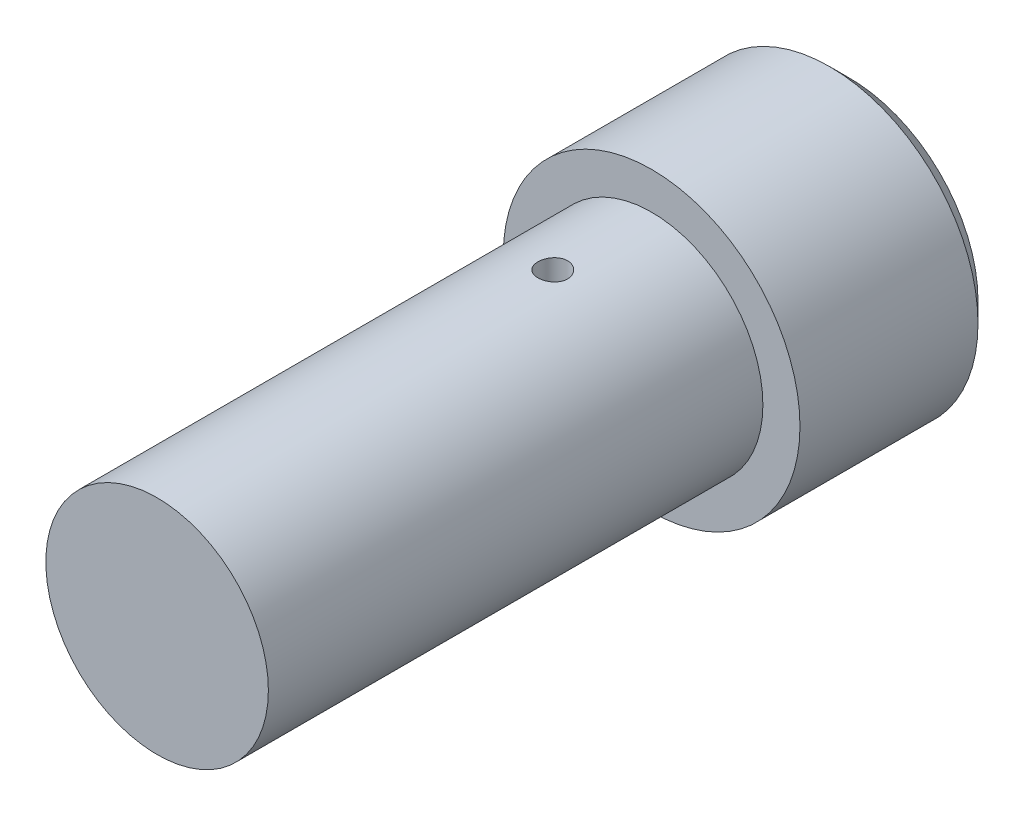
ISO-10303-21;
HEADER;
FILE_DESCRIPTION(('STEP AP214'),'2;1');
FILE_NAME('part.step','',(''),(''),'','','');
FILE_SCHEMA(('AUTOMOTIVE_DESIGN { 1 0 10303 214 1 1 1 1 }'));
ENDSEC;
DATA;
#1=APPLICATION_CONTEXT('core data for automotive mechanical design processes');
#2=APPLICATION_PROTOCOL_DEFINITION('international standard','automotive_design',2000,#1);
#3=PRODUCT_CONTEXT('',#1,'mechanical');
#4=PRODUCT('Part','Part','',(#3));
#5=PRODUCT_RELATED_PRODUCT_CATEGORY('part','',(#4));
#6=PRODUCT_DEFINITION_FORMATION('','',#4);
#7=PRODUCT_DEFINITION_CONTEXT('part definition',#1,'design');
#8=PRODUCT_DEFINITION('design','',#6,#7);
#9=PRODUCT_DEFINITION_SHAPE('','',#8);
#10=(LENGTH_UNIT() NAMED_UNIT(*) SI_UNIT(.MILLI.,.METRE.));
#11=(NAMED_UNIT(*) PLANE_ANGLE_UNIT() SI_UNIT($,.RADIAN.));
#12=(NAMED_UNIT(*) SI_UNIT($,.STERADIAN.) SOLID_ANGLE_UNIT());
#13=UNCERTAINTY_MEASURE_WITH_UNIT(LENGTH_MEASURE(1.E-05),#10,'distance_accuracy_value','');
#14=(GEOMETRIC_REPRESENTATION_CONTEXT(3) GLOBAL_UNCERTAINTY_ASSIGNED_CONTEXT((#13)) GLOBAL_UNIT_ASSIGNED_CONTEXT((#10,
#11,#12)) REPRESENTATION_CONTEXT('',''));
#15=CARTESIAN_POINT('',(0.,0.,0.));
#16=DIRECTION('',(0.,0.,1.));
#17=DIRECTION('',(1.,0.,0.));
#18=AXIS2_PLACEMENT_3D('',#15,#16,#17);
#19=CARTESIAN_POINT('',(0.,0.,40.));
#20=DIRECTION('',(0.,0.,1.));
#21=DIRECTION('',(1.00000000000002,0.,0.));
#22=AXIS2_PLACEMENT_3D('',#19,#20,#21);
#23=PLANE('',#22);
#24=CARTESIAN_POINT('',(0.,0.,40.));
#25=DIRECTION('',(0.,0.,1.));
#26=DIRECTION('',(1.00000000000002,0.,0.));
#27=AXIS2_PLACEMENT_3D('',#24,#25,#26);
#28=CIRCLE('',#27,30.);
#29=CARTESIAN_POINT('',(30.0000000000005,0.,40.));
#30=VERTEX_POINT('',#29);
#31=EDGE_CURVE('E42',#30,#30,#28,.T.);
#32=ORIENTED_EDGE('',*,*,#31,.T.);
#33=EDGE_LOOP('',(#32));
#34=FACE_BOUND('',#33,.T.);
#35=CARTESIAN_POINT('',(0.,0.,40.));
#36=DIRECTION('',(0.,0.,1.));
#37=DIRECTION('',(1.00000000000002,0.,0.));
#38=AXIS2_PLACEMENT_3D('',#35,#36,#37);
#39=CIRCLE('',#38,22.5);
#40=CARTESIAN_POINT('',(22.5000000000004,0.,40.));
#41=VERTEX_POINT('',#40);
#42=EDGE_CURVE('E55',#41,#41,#39,.T.);
#43=ORIENTED_EDGE('',*,*,#42,.F.);
#44=EDGE_LOOP('',(#43));
#45=FACE_BOUND('',#44,.T.);
#46=ADVANCED_FACE('F31',(#34,#45),#23,.T.);
#47=CARTESIAN_POINT('',(0.,0.,40.));
#48=DIRECTION('',(0.,0.,-1.));
#49=DIRECTION('',(-1.00000000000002,0.,0.));
#50=AXIS2_PLACEMENT_3D('',#47,#48,#49);
#51=CYLINDRICAL_SURFACE('',#50,30.);
#52=CARTESIAN_POINT('',(0.,0.,4.00000000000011));
#53=DIRECTION('',(0.,0.,1.));
#54=DIRECTION('',(1.00000000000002,0.,0.));
#55=AXIS2_PLACEMENT_3D('',#52,#53,#54);
#56=CIRCLE('',#55,30.);
#57=CARTESIAN_POINT('',(30.0000000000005,0.,4.00000000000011));
#58=VERTEX_POINT('',#57);
#59=EDGE_CURVE('E38',#58,#58,#56,.T.);
#60=ORIENTED_EDGE('',*,*,#59,.T.);
#61=EDGE_LOOP('',(#60));
#62=FACE_BOUND('',#61,.T.);
#63=ORIENTED_EDGE('',*,*,#31,.F.);
#64=EDGE_LOOP('',(#63));
#65=FACE_BOUND('',#64,.T.);
#66=ADVANCED_FACE('F33',(#62,#65),#51,.T.);
#67=CARTESIAN_POINT('',(0.,0.,0.));
#68=DIRECTION('',(0.,0.,1.));
#69=DIRECTION('',(1.00000000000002,0.,0.));
#70=AXIS2_PLACEMENT_3D('',#67,#68,#69);
#71=PLANE('',#70);
#72=CARTESIAN_POINT('',(0.,0.,0.));
#73=DIRECTION('',(0.,0.,1.));
#74=DIRECTION('',(1.00000000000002,0.,0.));
#75=AXIS2_PLACEMENT_3D('',#72,#73,#74);
#76=CIRCLE('',#75,26.);
#77=CARTESIAN_POINT('',(26.0000000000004,0.,0.));
#78=VERTEX_POINT('',#77);
#79=EDGE_CURVE('E10',#78,#78,#76,.F.);
#80=ORIENTED_EDGE('',*,*,#79,.T.);
#81=EDGE_LOOP('',(#80));
#82=FACE_BOUND('',#81,.T.);
#83=ADVANCED_FACE('F75',(#82),#71,.F.);
#84=CARTESIAN_POINT('',(0.,0.,140.));
#85=DIRECTION('',(0.,0.,-1.));
#86=DIRECTION('',(-1.00000000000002,0.,0.));
#87=AXIS2_PLACEMENT_3D('',#84,#85,#86);
#88=CYLINDRICAL_SURFACE('',#87,22.5);
#89=CARTESIAN_POINT('',(0.,22.5000000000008,63.0000000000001));
#90=CARTESIAN_POINT('',(-0.167713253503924,22.4999975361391,62.9999929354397));
#91=CARTESIAN_POINT('',(-0.335528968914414,22.498105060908,62.9858886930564));
#92=CARTESIAN_POINT('',(-0.666484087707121,22.4907376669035,62.9298504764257));
#93=CARTESIAN_POINT('',(-0.82961853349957,22.4852590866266,62.8878880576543));
#94=CARTESIAN_POINT('',(-1.1463724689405,22.4713361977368,62.7773974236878));
#95=CARTESIAN_POINT('',(-1.29999852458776,22.4628939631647,62.7088877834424));
#96=CARTESIAN_POINT('',(-1.59354584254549,22.4439807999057,62.5472896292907));
#97=CARTESIAN_POINT('',(-1.73346930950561,22.4335101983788,62.4542050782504));
#98=CARTESIAN_POINT('',(-1.99653873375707,22.4116349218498,62.2454801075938));
#99=CARTESIAN_POINT('',(-2.11958697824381,22.4002253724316,62.1297170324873));
#100=CARTESIAN_POINT('',(-2.34457103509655,22.3777970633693,61.8791847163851));
#101=CARTESIAN_POINT('',(-2.4465057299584,22.3667783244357,61.7444144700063));
#102=CARTESIAN_POINT('',(-2.62673853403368,22.3463315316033,61.4590513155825));
#103=CARTESIAN_POINT('',(-2.70494411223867,22.3369097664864,61.3083994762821));
#104=CARTESIAN_POINT('',(-2.83490767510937,22.3207888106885,60.9959533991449));
#105=CARTESIAN_POINT('',(-2.88666679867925,22.3140895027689,60.8341596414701));
#106=CARTESIAN_POINT('',(-2.96196910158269,22.3042190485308,60.5050412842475));
#107=CARTESIAN_POINT('',(-2.9856780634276,22.3010271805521,60.3377552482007));
#108=CARTESIAN_POINT('',(-3.00472020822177,22.2984697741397,60.0015507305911));
#109=CARTESIAN_POINT('',(-3.00005468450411,22.2991040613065,59.8326323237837));
#110=CARTESIAN_POINT('',(-2.96261618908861,22.3041083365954,59.4991183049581));
#111=CARTESIAN_POINT('',(-2.93002646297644,22.3084539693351,59.3345017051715));
#112=CARTESIAN_POINT('',(-2.83795086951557,22.3203532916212,59.0130947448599));
#113=CARTESIAN_POINT('',(-2.77846438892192,22.3279070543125,58.8563045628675));
#114=CARTESIAN_POINT('',(-2.63408893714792,22.3453989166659,58.5544355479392));
#115=CARTESIAN_POINT('',(-2.54912096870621,22.3553444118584,58.4093949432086));
#116=CARTESIAN_POINT('',(-2.35625090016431,22.3764935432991,58.1355613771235));
#117=CARTESIAN_POINT('',(-2.24834760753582,22.3876972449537,58.0067692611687));
#118=CARTESIAN_POINT('',(-2.01165735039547,22.4102084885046,57.7680254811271));
#119=CARTESIAN_POINT('',(-1.88271256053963,22.421516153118,57.6582302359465));
#120=CARTESIAN_POINT('',(-1.60814125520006,22.4428788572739,57.4618169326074));
#121=CARTESIAN_POINT('',(-1.46251469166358,22.4529338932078,57.3751989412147));
#122=CARTESIAN_POINT('',(-1.15858832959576,22.4706659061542,57.2275963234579));
#123=CARTESIAN_POINT('',(-1.00028336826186,22.4783419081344,57.1666222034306));
#124=CARTESIAN_POINT('',(-0.675556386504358,22.490442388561,57.0721660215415));
#125=CARTESIAN_POINT('',(-0.509134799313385,22.4948670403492,57.038682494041));
#126=CARTESIAN_POINT('',(-0.174250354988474,22.4999436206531,57.0003623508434));
#127=CARTESIAN_POINT('',(-0.00581255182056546,22.5006239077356,56.9953103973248));
#128=CARTESIAN_POINT('',(0.329507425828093,22.4982118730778,57.0134274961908));
#129=CARTESIAN_POINT('',(0.496389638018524,22.4951196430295,57.0365958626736));
#130=CARTESIAN_POINT('',(0.823220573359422,22.485527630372,57.110316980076));
#131=CARTESIAN_POINT('',(0.983193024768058,22.4790407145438,57.1607663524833));
#132=CARTESIAN_POINT('',(1.29240764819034,22.4633851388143,57.2875094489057));
#133=CARTESIAN_POINT('',(1.4416494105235,22.4542163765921,57.3638041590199));
#134=CARTESIAN_POINT('',(1.72612331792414,22.4341475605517,57.540588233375));
#135=CARTESIAN_POINT('',(1.86126872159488,22.4232377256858,57.6412160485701));
#136=CARTESIAN_POINT('',(2.11282942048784,22.4009359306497,57.8636149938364));
#137=CARTESIAN_POINT('',(2.22924386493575,22.3895439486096,57.9853870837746));
#138=CARTESIAN_POINT('',(2.44080824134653,22.3674735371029,58.2475697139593));
#139=CARTESIAN_POINT('',(2.53581491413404,22.3568002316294,58.3880963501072));
#140=CARTESIAN_POINT('',(2.70087526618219,22.3374619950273,58.6832391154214));
#141=CARTESIAN_POINT('',(2.77092950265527,22.3287970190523,58.8378549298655));
#142=CARTESIAN_POINT('',(2.88386754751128,22.3144921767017,59.1563358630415));
#143=CARTESIAN_POINT('',(2.92683043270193,22.308843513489,59.3201725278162));
#144=CARTESIAN_POINT('',(2.98462000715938,22.3011862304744,59.6528154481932));
#145=CARTESIAN_POINT('',(2.99944820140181,22.2991774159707,59.8216214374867));
#146=CARTESIAN_POINT('',(3.00051728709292,22.2990334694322,60.1579852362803));
#147=CARTESIAN_POINT('',(2.9869832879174,22.3008678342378,60.3255423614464));
#148=CARTESIAN_POINT('',(2.93219065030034,22.308137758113,60.6559768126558));
#149=CARTESIAN_POINT('',(2.89093202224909,22.313573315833,60.818854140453));
#150=CARTESIAN_POINT('',(2.78193465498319,22.327423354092,61.1352655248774));
#151=CARTESIAN_POINT('',(2.71420831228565,22.335836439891,61.2888039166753));
#152=CARTESIAN_POINT('',(2.55422014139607,22.3546956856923,61.5823738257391));
#153=CARTESIAN_POINT('',(2.46195783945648,22.3651418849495,61.7224050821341));
#154=CARTESIAN_POINT('',(2.25468672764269,22.3869895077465,61.9861344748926));
#155=CARTESIAN_POINT('',(2.13951040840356,22.3983975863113,62.1097004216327));
#156=CARTESIAN_POINT('',(1.89003254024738,22.4208257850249,62.3358348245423));
#157=CARTESIAN_POINT('',(1.75572651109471,22.4318458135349,62.4383983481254));
#158=CARTESIAN_POINT('',(1.47112948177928,22.4523095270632,62.6200007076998));
#159=CARTESIAN_POINT('',(1.32077193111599,22.4617461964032,62.6989359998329));
#160=CARTESIAN_POINT('',(1.00888861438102,22.4779098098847,62.8303208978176));
#161=CARTESIAN_POINT('',(0.847375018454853,22.4846396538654,62.8827988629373));
#162=CARTESIAN_POINT('',(0.570882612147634,22.4930358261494,62.9474220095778));
#163=CARTESIAN_POINT('',(0.457636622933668,22.495634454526,62.9671098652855));
#164=CARTESIAN_POINT('',(0.229609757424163,22.4991173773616,62.9934012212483));
#165=CARTESIAN_POINT('',(0.114828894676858,22.5000016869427,63.0000048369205));
#166=CARTESIAN_POINT('',(0.,22.5000000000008,63.0000000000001));
#167=B_SPLINE_CURVE_WITH_KNOTS('',3,(#89,#90,#91,#92,#93,#94,#95,#96,#97,#98,#99,#100,#101,#102,
#103,#104,#105,#106,#107,#108,#109,#110,#111,#112,#113,#114,#115,#116,#117,#118,#119,#120,#121,
#122,#123,#124,#125,#126,#127,#128,#129,#130,#131,#132,#133,#134,#135,#136,#137,#138,#139,#140,
#141,#142,#143,#144,#145,#146,#147,#148,#149,#150,#151,#152,#153,#154,#155,#156,#157,#158,#159,
#160,#161,#162,#163,#164,#165,#166),.UNSPECIFIED.,.T.,.F.,(4,2,2,2,2,2,2,2,2,2,2,2,2,2,2,2,2,2,
2,2,2,2,2,2,2,2,2,2,2,2,2,2,2,2,2,2,2,2,4),(0.,0.50272027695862,1.00595464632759,
1.50883753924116,2.01163938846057,2.51723967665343,3.02286671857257,3.53044082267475,
4.03799306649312,4.54253033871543,5.04704461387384,5.54827327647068,6.04951336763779,
6.55232374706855,7.05516027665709,7.56195816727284,8.06875751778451,8.57576430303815,
9.08274405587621,9.585878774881,10.0890012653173,10.590230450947,11.0914787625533,
11.5956491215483,12.0998423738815,12.6073155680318,13.1147774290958,13.6207511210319,
14.1266977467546,14.6286439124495,15.1305898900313,15.6323010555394,16.1340219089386,
16.6395550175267,17.1452067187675,17.6530429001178,18.1603335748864,18.5045360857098,
18.8487355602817),.UNSPECIFIED.);
#168=CARTESIAN_POINT('',(0.,22.5000000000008,63.0000000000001));
#169=VERTEX_POINT('',#168);
#170=EDGE_CURVE('E49',#169,#169,#167,.T.);
#171=ORIENTED_EDGE('',*,*,#170,.T.);
#172=EDGE_LOOP('',(#171));
#173=FACE_BOUND('',#172,.T.);
#174=CARTESIAN_POINT('',(0.,0.,140.));
#175=DIRECTION('',(0.,0.,1.));
#176=DIRECTION('',(1.00000000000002,0.,0.));
#177=AXIS2_PLACEMENT_3D('',#174,#175,#176);
#178=CIRCLE('',#177,22.5);
#179=CARTESIAN_POINT('',(22.5000000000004,0.,140.));
#180=VERTEX_POINT('',#179);
#181=EDGE_CURVE('E46',#180,#180,#178,.T.);
#182=ORIENTED_EDGE('',*,*,#181,.F.);
#183=EDGE_LOOP('',(#182));
#184=FACE_BOUND('',#183,.T.);
#185=ORIENTED_EDGE('',*,*,#42,.T.);
#186=EDGE_LOOP('',(#185));
#187=FACE_BOUND('',#186,.T.);
#188=ADVANCED_FACE('F58',(#173,#184,#187),#88,.T.);
#189=CARTESIAN_POINT('',(0.,0.,140.));
#190=DIRECTION('',(0.,0.,1.));
#191=DIRECTION('',(1.00000000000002,0.,0.));
#192=AXIS2_PLACEMENT_3D('',#189,#190,#191);
#193=PLANE('',#192);
#194=ORIENTED_EDGE('',*,*,#181,.T.);
#195=EDGE_LOOP('',(#194));
#196=FACE_BOUND('',#195,.T.);
#197=ADVANCED_FACE('F67',(#196),#193,.T.);
#198=CARTESIAN_POINT('',(0.,0.,60.0000000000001));
#199=DIRECTION('',(0.,1.00000000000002,0.));
#200=DIRECTION('',(0.,0.,1.));
#201=AXIS2_PLACEMENT_3D('',#198,#199,#200);
#202=CYLINDRICAL_SURFACE('',#201,3.);
#203=CARTESIAN_POINT('',(0.,0.,60.0000000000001));
#204=DIRECTION('',(0.,1.00000000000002,0.));
#205=DIRECTION('',(0.,0.,1.));
#206=AXIS2_PLACEMENT_3D('',#203,#204,#205);
#207=CIRCLE('',#206,3.);
#208=CARTESIAN_POINT('',(0.,0.,63.0000000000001));
#209=VERTEX_POINT('',#208);
#210=EDGE_CURVE('E56',#209,#209,#207,.T.);
#211=ORIENTED_EDGE('',*,*,#210,.F.);
#212=EDGE_LOOP('',(#211));
#213=FACE_BOUND('',#212,.T.);
#214=ORIENTED_EDGE('',*,*,#170,.F.);
#215=EDGE_LOOP('',(#214));
#216=FACE_BOUND('',#215,.T.);
#217=ADVANCED_FACE('F62',(#213,#216),#202,.F.);
#218=CARTESIAN_POINT('',(0.,0.,60.0000000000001));
#219=DIRECTION('',(0.,1.00000000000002,0.));
#220=DIRECTION('',(0.,0.,1.));
#221=AXIS2_PLACEMENT_3D('',#218,#219,#220);
#222=PLANE('',#221);
#223=ORIENTED_EDGE('',*,*,#210,.T.);
#224=EDGE_LOOP('',(#223));
#225=FACE_BOUND('',#224,.T.);
#226=ADVANCED_FACE('F66',(#225),#222,.T.);
#227=CARTESIAN_POINT('',(0.,0.,4.00000000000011));
#228=DIRECTION('',(0.,0.,1.));
#229=DIRECTION('',(1.00000000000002,0.,0.));
#230=AXIS2_PLACEMENT_3D('',#227,#228,#229);
#231=CONICAL_SURFACE('',#230,30.,0.785398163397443);
#232=ORIENTED_EDGE('',*,*,#79,.F.);
#233=EDGE_LOOP('',(#232));
#234=FACE_BOUND('',#233,.T.);
#235=ORIENTED_EDGE('',*,*,#59,.F.);
#236=EDGE_LOOP('',(#235));
#237=FACE_BOUND('',#236,.T.);
#238=ADVANCED_FACE('F114',(#234,#237),#231,.T.);
#239=CLOSED_SHELL('',(#46,#66,#83,#188,#197,#217,#226,#238));
#240=MANIFOLD_SOLID_BREP('B2',#239);
#241=ADVANCED_BREP_SHAPE_REPRESENTATION('',(#18,#240),#14);
#242=SHAPE_DEFINITION_REPRESENTATION(#9,#241);
ENDSEC;
END-ISO-10303-21;
